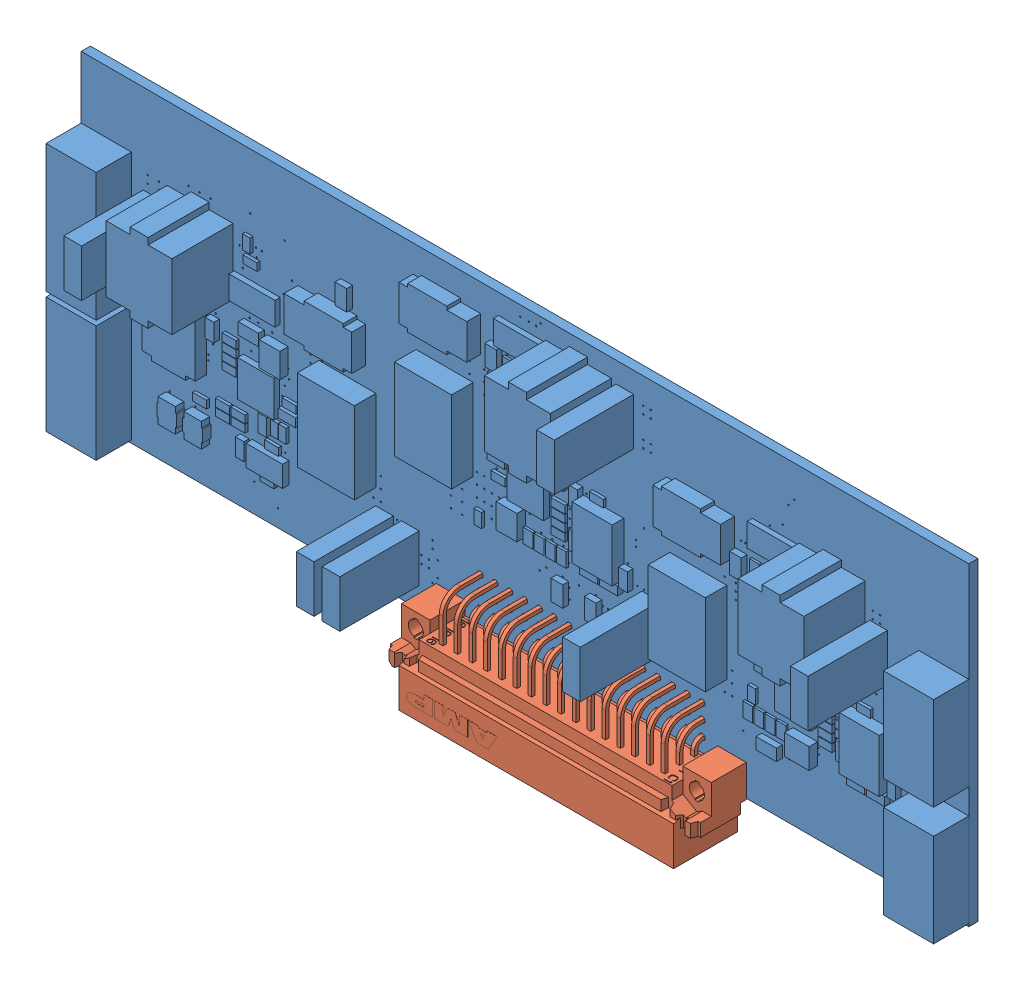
SolidWorks assembly SwitchBoardRemake.SLDASM, configuration Default (file format 9000). Lengths in mm.
Overall size (152.4 61.26 17.82).
2 component instances, 2 part files, 3 mates.
Components (placement in the parent):
- 100221094ra_REMAKE_solid-1-1: 100221094ra_REMAKE_solid-1.SLDPRT [Default] at origin size (152.4 53.98 17.82)
- c-650948-5-m-3d-1: c-650948-5-m-3d.SLDPRT [Default] at (87.5792 -7.2804 5.5073) x (1 0 0) z (0 -1 0) size (53.21 12.76 18.02)
Mates (geometry in assembly coordinates):
- Coincident1: coincident anti-aligned: plane of 100221094ra_REMAKE_solid-1-1 through (0 0 1.5723) normal (0 0 1); plane of c-650948-5-m-3d-1 through (64.0192 -0.1904 1.5723) normal (0 0 -1)
- Concentric1: concentric anti-aligned: cylinder of 100221094ra_REMAKE_solid-1-1 through (111.7092 2.8296 1.5723) axis (0 0 -1) radius 1.397; cylinder of c-650948-5-m-3d-1 through (111.7092 2.8296 7.5723) axis (0 0 1) radius 1.295
- Concentric2: concentric anti-aligned: cylinder of 100221094ra_REMAKE_solid-1-1 through (63.4492 2.8296 1.5723) axis (0 0 -1) radius 1.397; cylinder of c-650948-5-m-3d-1 through (63.4492 2.8296 7.5723) axis (0 0 1) radius 1.295
